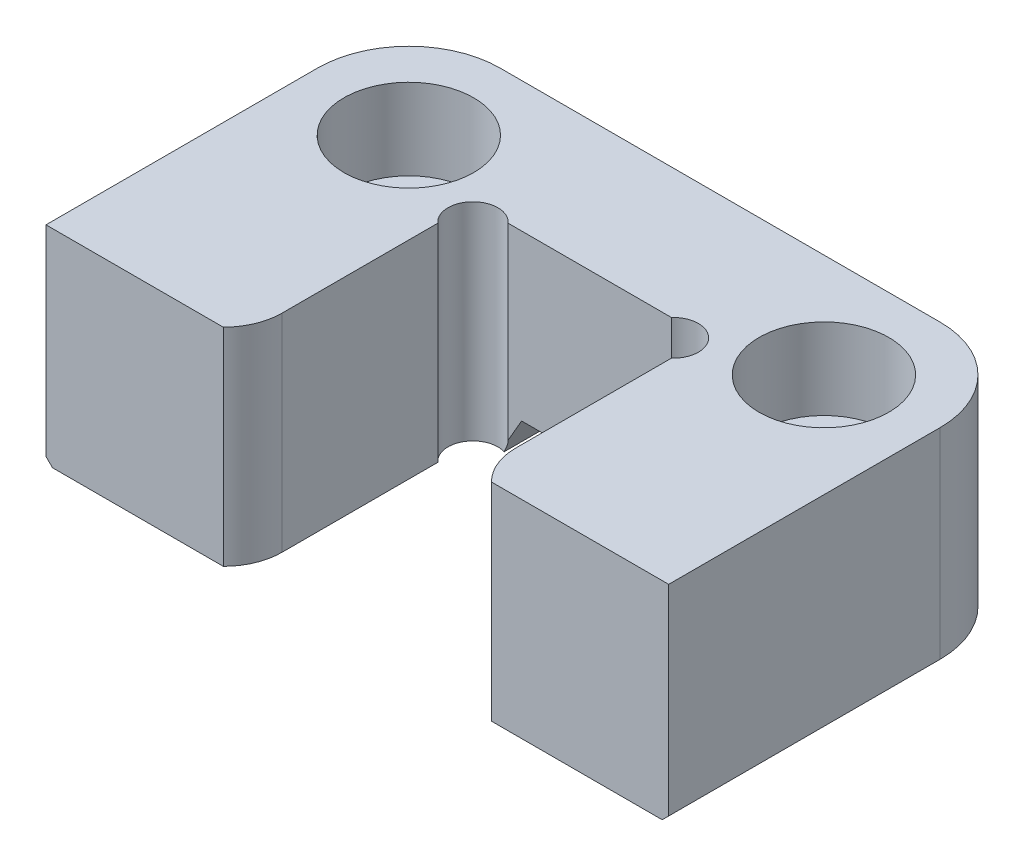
from build123d import *

# Parameters (mm, degrees)
BOSS_EXTRUDE1_DEPTH   = 12.6746
FILLET1_R             = 5.588
CUT_EXTRUDE1_DEPTH    = 32.880561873
SKETCH3_R             = 1.524
CUT_EXTRUDE2_DEPTH    = 32.880561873
CUT_EXTRUDE3_DEPTH    = 32.880561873
CHAMFER1_SIZE         = 0.396875
CHAMFER5_SIZE         = 3.81
CHAMFER5_SIZE2        = 1.020886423
F_8_CBORE_D           = 4.4958
F_8_CBORE_CBORE_D     = 7.9375
F_8_CBORE_CBORE_DEPTH = 4.96062


with BuildPart() as part:
    # Sketch1 → Boss-Extrude1 (new body)
    with BuildSketch(Plane(origin=(0, 0, 0), x_dir=(1, 0, 0), z_dir=(0, 1, 0))):
        Polygon((7.1501, 0), (19.05, 0), (19.05, 22.1996), (-19.05, 22.1996), (-19.05, 0), (-7.1501, 0), (-7.1501, 14.224), (7.1501, 14.224), align=None)
    extrude(amount=-BOSS_EXTRUDE1_DEPTH)

    # Fillet1
    fillet1_edges = [part.edges().sort_by_distance(p)[0] for p in [
        (-19.05, -6.3373, -22.1996),
        (19.05, -6.3373, -22.1996),
    ]]
    fillet(fillet1_edges, radius=FILLET1_R)

    # Sketch2 → Cut-Extrude1 (cut, through all)
    with BuildSketch(Plane(origin=(0, 0, 0), x_dir=(1, 0, 0), z_dir=(0, 1, 0))):
        with BuildLine():
            Line((-7.1501, 2.54), (-7.1501, 12.7))
            Line((-7.1501, 12.7), (7.1501, 12.7))
            Line((7.1501, 12.7), (7.1501, 2.54))
            ThreePointArc((7.1501, 2.54), (7.423618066, 1.165303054), (8.202509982, 0))
            Line((8.202509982, 0), (13.5001, 0))
            Line((13.5001, 0), (13.5001, -12.7))
            Line((13.5001, -12.7), (-13.5001, -12.7))
            Line((-13.5001, -12.7), (-13.5001, 0))
            Line((-13.5001, 0), (-8.202509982, 0))
            ThreePointArc((-8.202509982, 0), (-7.423618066, 1.165303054), (-7.1501, 2.54))
        make_face()
    extrude(amount=-CUT_EXTRUDE1_DEPTH, mode=Mode.SUBTRACT)

    # Sketch3 → Cut-Extrude2 (cut, through all)
    with BuildSketch(Plane(origin=(0, 0, 0), x_dir=(1, 0, 0), z_dir=(0, 1, 0))):
        with Locations((-6.1341, 13.208)):
            Circle(SKETCH3_R)
        with Locations((6.1341, 13.208)):
            Circle(SKETCH3_R)
    extrude(amount=-CUT_EXTRUDE2_DEPTH, mode=Mode.SUBTRACT)

    # Sketch5 → Cut-Extrude3 (cut, through all)
    with BuildSketch(Plane(origin=(0, 0, -22.1996), x_dir=(-1, 0, 0), z_dir=(0, 0, -1))):
        Polygon((-4.7625, -11.0871), (4.7625, -11.0871), (5.679043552, -12.6746), (-5.679043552, -12.6746), align=None)
    extrude(amount=-CUT_EXTRUDE3_DEPTH, mode=Mode.SUBTRACT)

    # Chamfer1
    chamfer1_edges = [part.edges().sort_by_distance(p)[0] for p in [
        (19.05, -12.6746, -8.3058),
        (9.570521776, -12.6746, -22.1996),
        (-19.05, -12.6746, -8.3058),
        (-17.413312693, -12.6746, -20.562912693),
        (17.413312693, -12.6746, -20.562912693),
        (-9.570521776, -12.6746, -22.1996),
    ]]
    chamfer(chamfer1_edges, length=CHAMFER1_SIZE)

    # Chamfer5
    chamfer5_edges = [part.edges().sort_by_distance(p)[0] for p in [
        (0, -11.0871, -14.224),
    ]]
    chamfer5_side = [part.faces().sort_by_distance(p)[0] for p in [
        (0, -11.0871, -18.2118),
    ]]
    chamfer(chamfer5_edges, length=CHAMFER5_SIZE, length2=CHAMFER5_SIZE2, reference=chamfer5_side[0])

    # 8 CBORE (through all)
    with Locations(Plane(origin=(9.083120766, 0, -5.226040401), x_dir=(-1, 0, 0), z_dir=(0, 1, 0))):
        with Locations((21.783120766, -10.623559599), (-3.616879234, -10.623559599)):
            CounterBoreHole(F_8_CBORE_D / 2, F_8_CBORE_CBORE_D / 2, F_8_CBORE_CBORE_DEPTH)


solid = part.part
